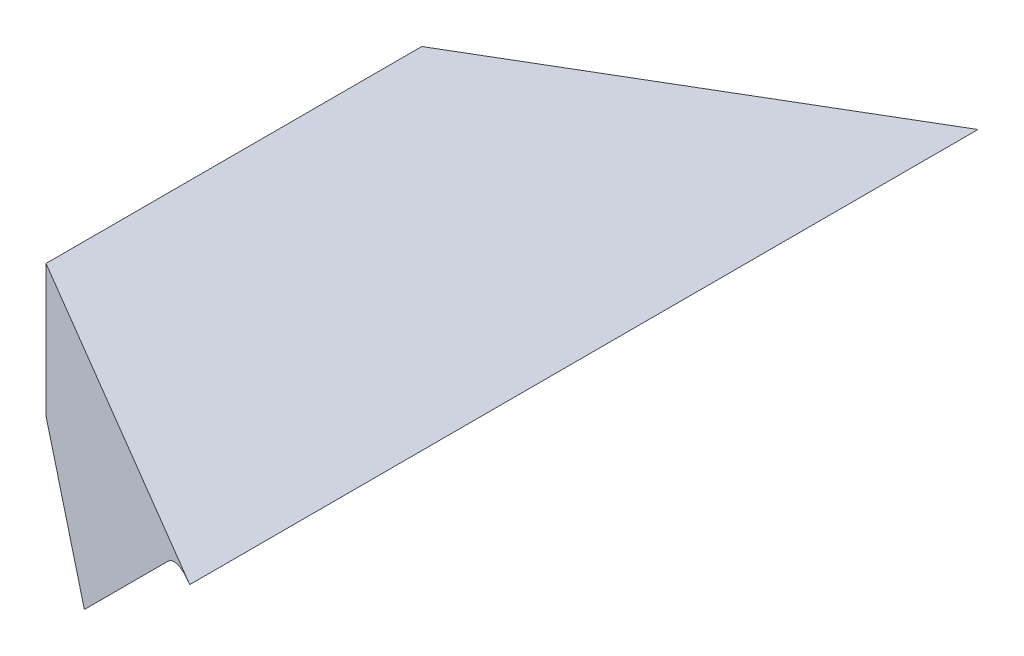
ISO-10303-21;
HEADER;
FILE_DESCRIPTION(('STEP AP214'),'2;1');
FILE_NAME('part.step','',(''),(''),'','','');
FILE_SCHEMA(('AUTOMOTIVE_DESIGN { 1 0 10303 214 1 1 1 1 }'));
ENDSEC;
DATA;
#1=APPLICATION_CONTEXT('core data for automotive mechanical design processes');
#2=APPLICATION_PROTOCOL_DEFINITION('international standard','automotive_design',2000,#1);
#3=PRODUCT_CONTEXT('',#1,'mechanical');
#4=PRODUCT('Part','Part','',(#3));
#5=PRODUCT_RELATED_PRODUCT_CATEGORY('part','',(#4));
#6=PRODUCT_DEFINITION_FORMATION('','',#4);
#7=PRODUCT_DEFINITION_CONTEXT('part definition',#1,'design');
#8=PRODUCT_DEFINITION('design','',#6,#7);
#9=PRODUCT_DEFINITION_SHAPE('','',#8);
#10=(LENGTH_UNIT() NAMED_UNIT(*) SI_UNIT(.MILLI.,.METRE.));
#11=(NAMED_UNIT(*) PLANE_ANGLE_UNIT() SI_UNIT($,.RADIAN.));
#12=(NAMED_UNIT(*) SI_UNIT($,.STERADIAN.) SOLID_ANGLE_UNIT());
#13=UNCERTAINTY_MEASURE_WITH_UNIT(LENGTH_MEASURE(1.E-05),#10,'distance_accuracy_value','');
#14=(GEOMETRIC_REPRESENTATION_CONTEXT(3) GLOBAL_UNCERTAINTY_ASSIGNED_CONTEXT((#13)) GLOBAL_UNIT_ASSIGNED_CONTEXT((#10,
#11,#12)) REPRESENTATION_CONTEXT('',''));
#15=CARTESIAN_POINT('',(0.,0.,0.));
#16=DIRECTION('',(0.,0.,1.));
#17=DIRECTION('',(1.,0.,0.));
#18=AXIS2_PLACEMENT_3D('',#15,#16,#17);
#19=CARTESIAN_POINT('',(-8.48528137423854,0.,20.));
#20=DIRECTION('',(1.,0.,0.));
#21=DIRECTION('',(0.,0.,-1.));
#22=AXIS2_PLACEMENT_3D('',#19,#20,#21);
#23=PLANE('',#22);
#24=DIRECTION('',(0.,0.,-1.));
#25=VECTOR('',#24,1.);
#26=CARTESIAN_POINT('',(-8.48528137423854,-7.02943725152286,20.));
#27=LINE('',#26,#25);
#28=CARTESIAN_POINT('',(-8.48528137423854,-7.02943725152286,10.));
#29=VERTEX_POINT('',#28);
#30=CARTESIAN_POINT('',(-8.48528137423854,-7.02943725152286,-10.));
#31=VERTEX_POINT('',#30);
#32=EDGE_CURVE('E104',#29,#31,#27,.T.);
#33=ORIENTED_EDGE('',*,*,#32,.F.);
#34=DIRECTION('',(0.,1.,0.));
#35=VECTOR('',#34,1.);
#36=CARTESIAN_POINT('',(-8.48528137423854,-12.,10.));
#37=LINE('',#36,#35);
#38=CARTESIAN_POINT('',(-8.48528137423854,0.,10.));
#39=VERTEX_POINT('',#38);
#40=EDGE_CURVE('E117',#29,#39,#37,.T.);
#41=ORIENTED_EDGE('',*,*,#40,.T.);
#42=DIRECTION('',(0.,0.,-1.));
#43=VECTOR('',#42,1.);
#44=CARTESIAN_POINT('',(-8.48528137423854,0.,20.));
#45=LINE('',#44,#43);
#46=CARTESIAN_POINT('',(-8.48528137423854,0.,-10.));
#47=VERTEX_POINT('',#46);
#48=EDGE_CURVE('E91',#39,#47,#45,.T.);
#49=ORIENTED_EDGE('',*,*,#48,.T.);
#50=DIRECTION('',(0.,1.,0.));
#51=VECTOR('',#50,1.);
#52=CARTESIAN_POINT('',(-8.48528137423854,-12.,-10.));
#53=LINE('',#52,#51);
#54=EDGE_CURVE('E97',#31,#47,#53,.T.);
#55=ORIENTED_EDGE('',*,*,#54,.F.);
#56=EDGE_LOOP('',(#33,#41,#49,#55));
#57=FACE_BOUND('',#56,.T.);
#58=ADVANCED_FACE('F36',(#57),#23,.F.);
#59=CARTESIAN_POINT('',(-3.5147186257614,-12.,20.));
#60=DIRECTION('',(-0.707106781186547,-0.707106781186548,0.));
#61=DIRECTION('',(0.707106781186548,-0.707106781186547,0.));
#62=AXIS2_PLACEMENT_3D('',#59,#60,#61);
#63=PLANE('',#62);
#64=DIRECTION('',(0.652713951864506,-0.652713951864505,0.384615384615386));
#65=VECTOR('',#64,1.);
#66=CARTESIAN_POINT('',(-1.73957069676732,-13.7751479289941,13.9749481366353));
#67=LINE('',#66,#65);
#68=CARTESIAN_POINT('',(-3.5147186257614,-12.,12.9289321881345));
#69=VERTEX_POINT('',#68);
#70=EDGE_CURVE('E98',#29,#69,#67,.T.);
#71=ORIENTED_EDGE('',*,*,#70,.F.);
#72=ORIENTED_EDGE('',*,*,#32,.T.);
#73=DIRECTION('',(0.652713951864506,-0.652713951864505,-0.384615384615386));
#74=VECTOR('',#73,1.);
#75=CARTESIAN_POINT('',(-11.7813238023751,-3.73339482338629,-8.0577883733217));
#76=LINE('',#75,#74);
#77=CARTESIAN_POINT('',(-3.5147186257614,-12.,-12.9289321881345));
#78=VERTEX_POINT('',#77);
#79=EDGE_CURVE('E108',#31,#78,#76,.T.);
#80=ORIENTED_EDGE('',*,*,#79,.T.);
#81=DIRECTION('',(0.,0.,-1.));
#82=VECTOR('',#81,1.);
#83=CARTESIAN_POINT('',(-3.5147186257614,-12.,20.));
#84=LINE('',#83,#82);
#85=EDGE_CURVE('E106',#69,#78,#84,.T.);
#86=ORIENTED_EDGE('',*,*,#85,.F.);
#87=EDGE_LOOP('',(#71,#72,#80,#86));
#88=FACE_BOUND('',#87,.T.);
#89=ADVANCED_FACE('F126',(#88),#63,.T.);
#90=CARTESIAN_POINT('',(8.48528137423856,0.,20.));
#91=DIRECTION('',(0.707106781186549,-0.707106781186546,0.));
#92=DIRECTION('',(0.707106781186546,0.707106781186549,0.));
#93=AXIS2_PLACEMENT_3D('',#90,#91,#92);
#94=PLANE('',#93);
#95=DIRECTION('',(0.652713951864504,0.652713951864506,-0.384615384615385));
#96=VECTOR('',#95,1.);
#97=CARTESIAN_POINT('',(-1.55647173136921,-10.0417531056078,-14.0828402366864));
#98=LINE('',#97,#96);
#99=CARTESIAN_POINT('',(7.31370849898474,-1.17157287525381,-19.3096440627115));
#100=VERTEX_POINT('',#99);
#101=EDGE_CURVE('E111',#78,#100,#98,.T.);
#102=ORIENTED_EDGE('',*,*,#101,.T.);
#103=DIRECTION('',(0.,0.,-1.));
#104=VECTOR('',#103,1.);
#105=CARTESIAN_POINT('',(7.31370849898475,-1.17157287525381,20.));
#106=LINE('',#105,#104);
#107=CARTESIAN_POINT('',(7.31370849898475,-1.17157287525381,19.3096440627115));
#108=VERTEX_POINT('',#107);
#109=EDGE_CURVE('E56',#100,#108,#106,.F.);
#110=ORIENTED_EDGE('',*,*,#109,.T.);
#111=DIRECTION('',(0.652713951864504,0.652713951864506,0.384615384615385));
#112=VECTOR('',#111,1.);
#113=CARTESIAN_POINT('',(8.48528137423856,0.,20.));
#114=LINE('',#113,#112);
#115=EDGE_CURVE('E115',#69,#108,#114,.T.);
#116=ORIENTED_EDGE('',*,*,#115,.F.);
#117=ORIENTED_EDGE('',*,*,#85,.T.);
#118=EDGE_LOOP('',(#102,#110,#116,#117));
#119=FACE_BOUND('',#118,.T.);
#120=ADVANCED_FACE('F128',(#119),#94,.T.);
#121=CARTESIAN_POINT('',(8.48528137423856,-12.,-20.));
#122=DIRECTION('',(-0.507673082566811,0.,-0.861549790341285));
#123=DIRECTION('',(-0.861549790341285,0.,0.507673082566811));
#124=AXIS2_PLACEMENT_3D('',#121,#122,#123);
#125=PLANE('',#124);
#126=ORIENTED_EDGE('',*,*,#54,.T.);
#127=DIRECTION('',(-0.861549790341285,0.,0.507673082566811));
#128=VECTOR('',#127,1.);
#129=CARTESIAN_POINT('',(8.48528137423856,0.,-20.));
#130=LINE('',#129,#128);
#131=CARTESIAN_POINT('',(10.1421356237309,0.,-20.9763107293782));
#132=VERTEX_POINT('',#131);
#133=EDGE_CURVE('E85',#132,#47,#130,.T.);
#134=ORIENTED_EDGE('',*,*,#133,.F.);
#135=CARTESIAN_POINT('',(10.1421356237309,-4.,-20.9763107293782));
#136=DIRECTION('',(-0.507673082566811,0.,-0.861549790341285));
#137=DIRECTION('',(-0.861549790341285,0.,0.507673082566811));
#138=AXIS2_PLACEMENT_3D('',#135,#136,#137);
#139=ELLIPSE('',#138,4.64279609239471,4.);
#140=EDGE_CURVE('E43',#132,#100,#139,.F.);
#141=ORIENTED_EDGE('',*,*,#140,.T.);
#142=ORIENTED_EDGE('',*,*,#101,.F.);
#143=ORIENTED_EDGE('',*,*,#79,.F.);
#144=EDGE_LOOP('',(#126,#134,#141,#142,#143));
#145=FACE_BOUND('',#144,.T.);
#146=ADVANCED_FACE('F94',(#145),#125,.T.);
#147=CARTESIAN_POINT('',(8.48528137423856,-12.,20.));
#148=DIRECTION('',(0.50767308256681,0.,-0.861549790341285));
#149=DIRECTION('',(-0.861549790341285,0.,-0.50767308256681));
#150=AXIS2_PLACEMENT_3D('',#147,#148,#149);
#151=PLANE('',#150);
#152=ORIENTED_EDGE('',*,*,#70,.T.);
#153=ORIENTED_EDGE('',*,*,#115,.T.);
#154=CARTESIAN_POINT('',(10.1421356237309,-4.,20.9763107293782));
#155=DIRECTION('',(0.50767308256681,0.,-0.861549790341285));
#156=DIRECTION('',(0.861549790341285,0.,0.50767308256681));
#157=AXIS2_PLACEMENT_3D('',#154,#155,#156);
#158=ELLIPSE('',#157,4.64279609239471,4.);
#159=CARTESIAN_POINT('',(10.1421356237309,0.,20.9763107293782));
#160=VERTEX_POINT('',#159);
#161=EDGE_CURVE('E11',#108,#160,#158,.T.);
#162=ORIENTED_EDGE('',*,*,#161,.T.);
#163=DIRECTION('',(-0.861549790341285,0.,-0.50767308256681));
#164=VECTOR('',#163,1.);
#165=CARTESIAN_POINT('',(8.48528137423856,0.,20.));
#166=LINE('',#165,#164);
#167=EDGE_CURVE('E88',#160,#39,#166,.T.);
#168=ORIENTED_EDGE('',*,*,#167,.T.);
#169=ORIENTED_EDGE('',*,*,#40,.F.);
#170=EDGE_LOOP('',(#152,#153,#162,#168,#169));
#171=FACE_BOUND('',#170,.T.);
#172=ADVANCED_FACE('F121',(#171),#151,.F.);
#173=CARTESIAN_POINT('',(10.1421356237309,-4.,25.));
#174=DIRECTION('',(0.,0.,1.));
#175=DIRECTION('',(1.,0.,0.));
#176=AXIS2_PLACEMENT_3D('',#173,#174,#175);
#177=CYLINDRICAL_SURFACE('',#176,4.);
#178=ORIENTED_EDGE('',*,*,#161,.F.);
#179=ORIENTED_EDGE('',*,*,#109,.F.);
#180=ORIENTED_EDGE('',*,*,#140,.F.);
#181=DIRECTION('',(0.,0.,-1.));
#182=VECTOR('',#181,1.);
#183=CARTESIAN_POINT('',(10.1421356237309,0.,-20.));
#184=LINE('',#183,#182);
#185=EDGE_CURVE('E83',#160,#132,#184,.T.);
#186=ORIENTED_EDGE('',*,*,#185,.F.);
#187=EDGE_LOOP('',(#178,#179,#180,#186));
#188=FACE_BOUND('',#187,.T.);
#189=ADVANCED_FACE('F100',(#188),#177,.F.);
#190=CARTESIAN_POINT('',(-25.,0.,25.));
#191=DIRECTION('',(0.,-1.,0.));
#192=DIRECTION('',(0.,0.,-1.));
#193=AXIS2_PLACEMENT_3D('',#190,#191,#192);
#194=PLANE('',#193);
#195=ORIENTED_EDGE('',*,*,#167,.F.);
#196=ORIENTED_EDGE('',*,*,#185,.T.);
#197=ORIENTED_EDGE('',*,*,#133,.T.);
#198=ORIENTED_EDGE('',*,*,#48,.F.);
#199=EDGE_LOOP('',(#195,#196,#197,#198));
#200=FACE_BOUND('',#199,.T.);
#201=ADVANCED_FACE('F84',(#200),#194,.F.);
#202=CLOSED_SHELL('',(#58,#89,#120,#146,#172,#189,#201));
#203=MANIFOLD_SOLID_BREP('B2',#202);
#204=ADVANCED_BREP_SHAPE_REPRESENTATION('',(#18,#203),#14);
#205=SHAPE_DEFINITION_REPRESENTATION(#9,#204);
ENDSEC;
END-ISO-10303-21;
